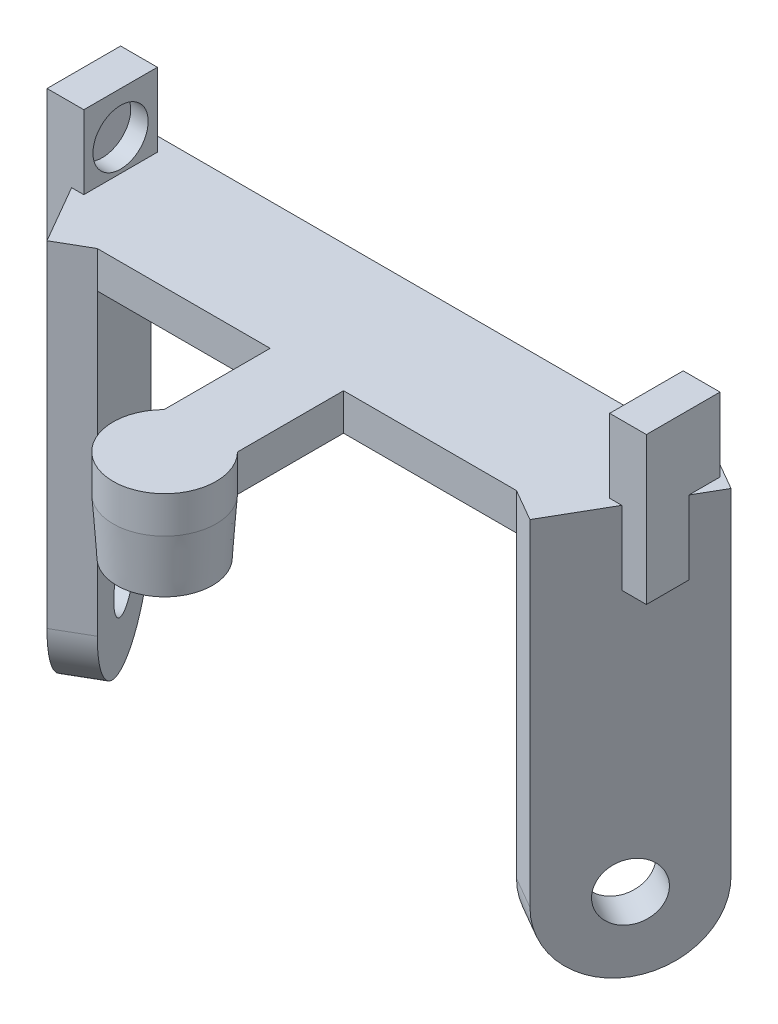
from build123d import *

# Parameters (mm, degrees)
BOSS_EXTRUDE1_DEPTH       = 2
BOSS_EXTRUDE2_DEPTH       = 2
SKETCH11_R                = 1.55
CUT_EXTRUDE1_DEPTH        = 2
SKETCH12_R                = 1.55
CUT_EXTRUDE2_DEPTH        = 2
BOSS_EXTRUDE4_DEPTH       = 2
BOSS_EXTRUDE7_DEPTH       = 40
DRAFT2_ANGLE              = 2
SKETCH19_R                = 1
BOSS_EXTRUDE8_DEPTH       = 10
SKETCH20_R                = 0.5
CUT_EXTRUDE3_DEPTH        = 5
DRAFT2_OF_MIRROR1_2_ANGLE = 2
DRAFT3_ANGLE              = 1.5
DRAFT4_ANGLE              = 1.5
DRAFT5_ANGLE              = 1.5
DRAFT6_ANGLE              = 1.5
CUT_EXTRUDE4_DEPTH        = 40
BOSS_EXTRUDE10_DEPTH      = 18
BOSS_EXTRUDE11_DEPTH      = 4
SKETCH33_R                = 1.5
CUT_EXTRUDE5_DEPTH        = 1
SKETCH35_W                = 28.577845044
SKETCH35_H                = 25.896486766
CUT_EXTRUDE6_DEPTH        = 40


with BuildPart() as part:
    # Sketch8 → Boss-Extrude1 (new body)
    with BuildSketch(Plane(origin=(0, 0, 0), x_dir=(0.5000000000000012, 0, 0.8660254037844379), z_dir=(-0.8660254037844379, 0, 0.5000000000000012))):
        with BuildLine():
            Line((-30.783, 0), (-30.783, 16.25))
            Line((-30.783, 16.25), (-22.783, 16.25))
            Line((-22.783, 16.25), (-22.783, 0))
            ThreePointArc((-22.783, 0), (-26.783, -4), (-30.783, 0))
        make_face()
    extrude(amount=BOSS_EXTRUDE1_DEPTH)

    # Sketch12 → Cut-Extrude2 (cut)
    with BuildSketch(Plane(origin=(0, 0, 0), x_dir=(-0.5000000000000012, 0, -0.866025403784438), z_dir=(0.866025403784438, 0, -0.5000000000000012))):
        with Locations((26.783, 0)):
            Circle(SKETCH12_R)
    extrude(amount=-CUT_EXTRUDE2_DEPTH, mode=Mode.SUBTRACT)



with BuildPart() as body_2:
    # Sketch10 → Boss-Extrude2 (new body)
    with BuildSketch(Plane(origin=(0, 0, 0), x_dir=(0.500000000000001, 0, -0.866025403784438), z_dir=(0.866025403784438, 0, 0.500000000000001))):
        with BuildLine():
            Line((22.783, 0), (22.783, 16.25))
            Line((22.783, 16.25), (30.783, 16.25))
            Line((30.783, 16.25), (30.783, 0))
            ThreePointArc((30.783, 0), (26.783, -4), (22.783, 0))
        make_face()
    extrude(amount=BOSS_EXTRUDE2_DEPTH)

    # Sketch11 → Cut-Extrude1 (cut)
    with BuildSketch(Plane(origin=(0, 0, 0), x_dir=(-0.500000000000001, 0, 0.8660254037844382), z_dir=(-0.8660254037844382, 0, -0.500000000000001))):
        with Locations((-26.783, 0)):
            Circle(SKETCH11_R)
    extrude(amount=-CUT_EXTRUDE1_DEPTH, mode=Mode.SUBTRACT)


with BuildPart() as part_1:
    add(part.part)

    add(body_2.part)  # Boss-Extrude4 merges body 2
    # Sketch13 → Boss-Extrude4 (add)
    with BuildSketch(Plane(origin=(0, 16.25, 0), x_dir=(1, 0, 0), z_dir=(0, 1, 0))):
        with BuildLine():
            Line((-17.123550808, 25.658860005), (-15.3915, 26.658860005))
            Line((-15.3915, 26.658860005), (15.3915, 26.658860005))
            Line((15.3915, 26.658860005), (17.123550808, 25.658860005))
            Line((17.123550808, 25.658860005), (13.123550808, 18.730656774))
            Line((13.123550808, 18.730656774), (11.3915, 19.730656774))
            Line((11.3915, 19.730656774), (1.994081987, 19.730656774))
            Line((1.994081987, 19.730656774), (1.994081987, 13.965613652))
            ThreePointArc((1.994081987, 13.965613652), (0, 9.2), (-1.994081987, 13.965613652))
            Line((-1.994081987, 13.965613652), (-1.994081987, 19.730656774))
            Line((-1.994081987, 19.730656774), (-11.3915, 19.730656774))
            Line((-11.3915, 19.730656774), (-13.123550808, 18.730656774))
            Line((-13.123550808, 18.730656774), (-17.123550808, 25.658860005))
        make_face()
    extrude(amount=BOSS_EXTRUDE4_DEPTH)

    # Sketch14 → Revolve1 (revolve)
    with BuildSketch(Plane(origin=(0, 0, 0), x_dir=(0, 0, -1), z_dir=(1, 0, 0))):
        Polygon((9.2, 16.25), (12, 16.25), (12, 13.25), (9.4, 13.25), align=None)
    revolve(axis=Axis((0, 16.25, -12), (0, -1, 0)))

    # Sketch15 → Boss-Extrude7 (add)
    with BuildSketch(Plane(origin=(0, 18.25, 0), x_dir=(1, 0, 0), z_dir=(0, 1, 0))):
        Polygon((-12.899224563, 23.19475839), (-12.899224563, 24.19475839), (-7.904492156, 24.19475839), (-7.904492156, 22.19475839), (-12.899224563, 22.19475839), align=None)
    boss_extrude7 = extrude(amount=BOSS_EXTRUDE7_DEPTH)

    # Draft2
    draft2_faces = [part_1.faces().sort_by_distance(p)[0] for p in [
        (-10.401858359, 38.25, -24.19475839),
        (-12.899224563, 38.25, -23.19475839),
    ]]
    draft(draft2_faces, Plane.ZX.offset(58.25), DRAFT2_ANGLE)

    # Sketch19 → Boss-Extrude8 (add)
    with BuildSketch(Plane.XY.offset(-22.19475839)):
        with Locations(Location((-10.401858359, 55.524846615, 0), (0, 0, 180))):
            Circle(SKETCH19_R)
        with Locations(Location((-10.401858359, 43.05, 0), (0, 0, 180))):
            Circle(SKETCH19_R)
    boss_extrude8 = extrude(amount=BOSS_EXTRUDE8_DEPTH)

    # Sketch20 → Cut-Extrude3 (cut)
    with BuildSketch(Plane.XY.offset(-12.19475839)):
        with Locations((-10.401858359, 55.524846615)):
            Circle(SKETCH20_R)
        with Locations((-10.401858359, 43.05)):
            Circle(SKETCH20_R)
    cut_extrude3 = extrude(amount=-CUT_EXTRUDE3_DEPTH, mode=Mode.SUBTRACT)

    # Mirror1: Boss-Extrude7, Boss-Extrude8, Cut-Extrude3 across plane
    add(boss_extrude7.mirror(Plane(origin=(0, 0, 0), x_dir=(0, 0, 1), z_dir=(1, 0, 0))))
    add(boss_extrude8.mirror(Plane(origin=(0, 0, 0), x_dir=(0, 0, 1), z_dir=(1, 0, 0))))
    add(cut_extrude3.mirror(Plane(origin=(0, 0, 0), x_dir=(0, 0, 1), z_dir=(1, 0, 0))), mode=Mode.SUBTRACT)

    # Draft2 of Mirror1 2
    draft2_of_mirror1_2_faces = [part_1.faces().sort_by_distance(p)[0] for p in [
        (10.401858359, 38.25, -24.19475839),
        (12.899224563, 38.25, -23.19475839),
    ]]
    draft(draft2_of_mirror1_2_faces, Plane.ZX.offset(58.25), DRAFT2_OF_MIRROR1_2_ANGLE)

    # Draft3
    draft3_faces = [part_1.faces().sort_by_distance(p)[0] for p in [
        (-9.401858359, 55.524846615, -17.19475839),
    ]]
    draft(draft3_faces, Plane(origin=(-10.401858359, 55.524846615, -12.19475839), x_dir=(1, 0, 0), z_dir=(0, 0, 1)), DRAFT3_ANGLE)

    # Draft4
    draft4_faces = [part_1.faces().sort_by_distance(p)[0] for p in [
        (9.401858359, 55.524846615, -17.19475839),
    ]]
    draft(draft4_faces, Plane(origin=(10.401858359, 55.524846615, -12.19475839), x_dir=(1, 0, 0), z_dir=(0, 0, 1)), DRAFT4_ANGLE)

    # Draft5
    draft5_faces = [part_1.faces().sort_by_distance(p)[0] for p in [
        (-9.401858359, 43.05, -17.19475839),
    ]]
    draft(draft5_faces, Plane(origin=(-10.401858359, 43.05, -12.19475839), x_dir=(1, 0, 0), z_dir=(0, 0, 1)), DRAFT5_ANGLE)

    # Draft6
    draft6_faces = [part_1.faces().sort_by_distance(p)[0] for p in [
        (9.401858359, 43.05, -17.19475839),
    ]]
    draft(draft6_faces, Plane(origin=(10.401858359, 43.05, -12.19475839), x_dir=(1, 0, 0), z_dir=(0, 0, 1)), DRAFT6_ANGLE)

    # Sketch24 → Cut-Extrude4 (cut)
    with BuildSketch(Plane(origin=(0, 58.25, 0), x_dir=(1, 0, 0), z_dir=(0, 1, 0))):
        Polygon((-8.809375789, 24.19475839), (-8.809375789, 22.19475839), (-7.904492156, 22.19475839), (-7.904492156, 25.591589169), (-8.809375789, 25.591589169), align=None)
    cut_extrude4 = extrude(amount=-CUT_EXTRUDE4_DEPTH, mode=Mode.SUBTRACT)

    # Mirror2: Cut-Extrude4 across plane
    add(cut_extrude4.mirror(Plane(origin=(0, 0, 0), x_dir=(0, 0, 1), z_dir=(1, 0, 0))), mode=Mode.SUBTRACT)

    # Sketch25 → Boss-Extrude10 (add)
    with BuildSketch(Plane(origin=(-8.809375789, 0, 0), x_dir=(0, 0, -1), z_dir=(1, 0, 0))):
        Polygon((22.19475839, 23.25), (25.416985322, 23.25), (25.347212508, 25.248031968), (22.19475839, 25.248031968), align=None)
    extrude(amount=BOSS_EXTRUDE10_DEPTH)

    # Sketch34 → Boss-Extrude11 (add, symmetric)
    with BuildSketch(Plane(origin=(0, 18.25, 0), x_dir=(1, 0, 0), z_dir=(0, 1, 0))):
        Polygon((-14.288922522, 23.89475839), (-14.288922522, 25.896486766), (-16.286942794, 25.896486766), (-16.286942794, 21.897538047), (-14.288922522, 21.897538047), align=None)
    boss_extrude11 = extrude(amount=BOSS_EXTRUDE11_DEPTH, both=True)

    # Sketch33 → Cut-Extrude5 (cut)
    with BuildSketch(Plane(origin=(-14.915170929, 0.520849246, 0), x_dir=(0, 0, 1), z_dir=(-0.9993908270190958, 0.03489949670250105, 0))):
        with Locations(Location((-23.89475839, 19.444339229, 0), (0, 0, 270))):
            Circle(SKETCH33_R)
    cut_extrude5 = extrude(amount=CUT_EXTRUDE5_DEPTH, mode=Mode.SUBTRACT)

    # Mirror3: Boss-Extrude11, Cut-Extrude5 across plane
    add(boss_extrude11.mirror(Plane(origin=(0, 0, 0), x_dir=(0, 0, 1), z_dir=(1, 0, 0))))
    add(cut_extrude5.mirror(Plane(origin=(0, 0, 0), x_dir=(0, 0, 1), z_dir=(1, 0, 0))), mode=Mode.SUBTRACT)

    # Sketch35 → Cut-Extrude6 (cut)
    with BuildSketch(Plane(origin=(0, 18.25, 0), x_dir=(1, 0, 0), z_dir=(0, 1, 0))):
        with Locations((0, 12.948243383)):
            Rectangle(SKETCH35_W, SKETCH35_H)
    extrude(amount=CUT_EXTRUDE6_DEPTH, mode=Mode.SUBTRACT)


solid = part_1.part
